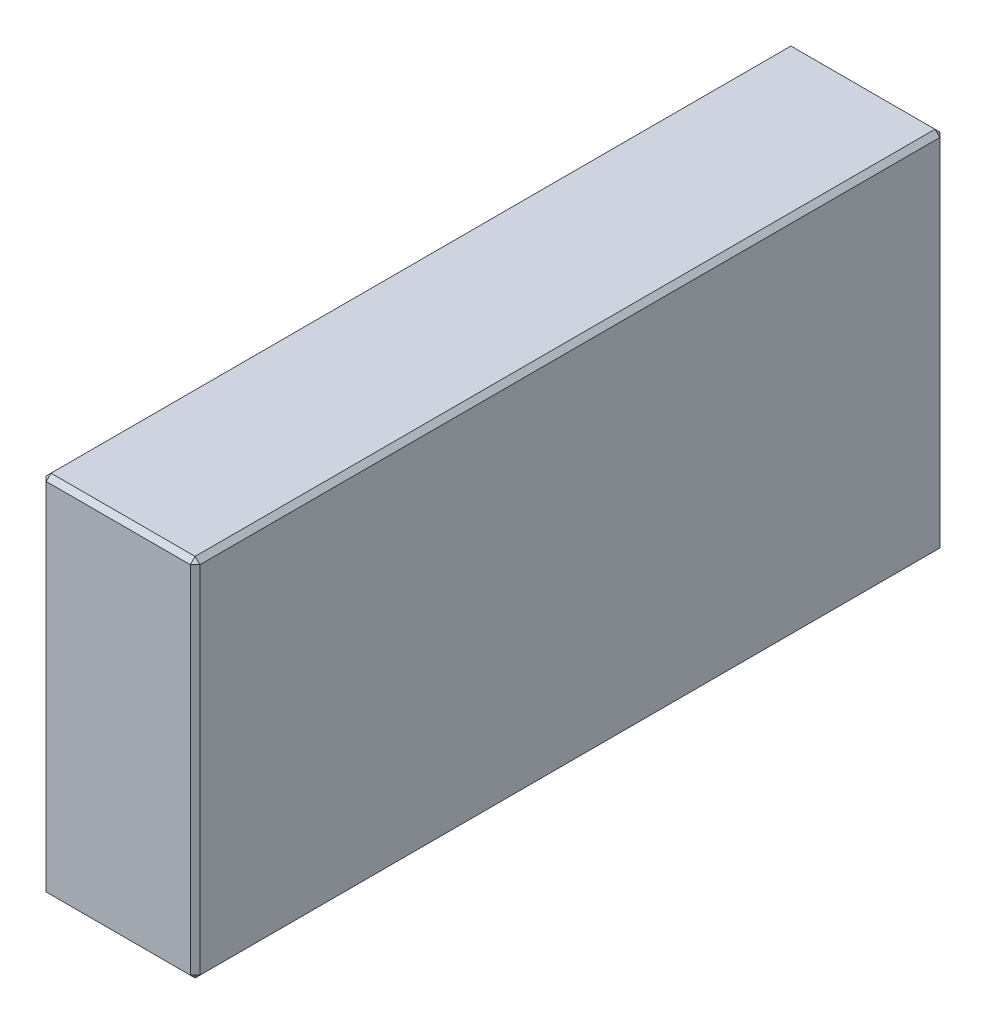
ISO-10303-21;
HEADER;
FILE_DESCRIPTION(('STEP AP214'),'2;1');
FILE_NAME('part.step','',(''),(''),'','','');
FILE_SCHEMA(('AUTOMOTIVE_DESIGN { 1 0 10303 214 1 1 1 1 }'));
ENDSEC;
DATA;
#1=APPLICATION_CONTEXT('core data for automotive mechanical design processes');
#2=APPLICATION_PROTOCOL_DEFINITION('international standard','automotive_design',2000,#1);
#3=PRODUCT_CONTEXT('',#1,'mechanical');
#4=PRODUCT('Part','Part','',(#3));
#5=PRODUCT_RELATED_PRODUCT_CATEGORY('part','',(#4));
#6=PRODUCT_DEFINITION_FORMATION('','',#4);
#7=PRODUCT_DEFINITION_CONTEXT('part definition',#1,'design');
#8=PRODUCT_DEFINITION('design','',#6,#7);
#9=PRODUCT_DEFINITION_SHAPE('','',#8);
#10=(LENGTH_UNIT() NAMED_UNIT(*) SI_UNIT(.MILLI.,.METRE.));
#11=(NAMED_UNIT(*) PLANE_ANGLE_UNIT() SI_UNIT($,.RADIAN.));
#12=(NAMED_UNIT(*) SI_UNIT($,.STERADIAN.) SOLID_ANGLE_UNIT());
#13=UNCERTAINTY_MEASURE_WITH_UNIT(LENGTH_MEASURE(1.E-05),#10,'distance_accuracy_value','');
#14=(GEOMETRIC_REPRESENTATION_CONTEXT(3) GLOBAL_UNCERTAINTY_ASSIGNED_CONTEXT((#13)) GLOBAL_UNIT_ASSIGNED_CONTEXT((#10,
#11,#12)) REPRESENTATION_CONTEXT('',''));
#15=CARTESIAN_POINT('',(0.,0.,0.));
#16=DIRECTION('',(0.,0.,1.));
#17=DIRECTION('',(1.,0.,0.));
#18=AXIS2_PLACEMENT_3D('',#15,#16,#17);
#19=CARTESIAN_POINT('',(-16.,76.,78.));
#20=DIRECTION('',(1.,0.,0.));
#21=DIRECTION('',(0.,0.,-1.));
#22=AXIS2_PLACEMENT_3D('',#19,#20,#21);
#23=PLANE('',#22);
#24=DIRECTION('',(0.,-1.,0.));
#25=VECTOR('',#24,1.);
#26=CARTESIAN_POINT('',(-16.,76.,-77.));
#27=LINE('',#26,#25);
#28=CARTESIAN_POINT('',(-16.,75.,-77.));
#29=VERTEX_POINT('',#28);
#30=CARTESIAN_POINT('',(-16.,1.00000000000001,-77.));
#31=VERTEX_POINT('',#30);
#32=EDGE_CURVE('E114',#29,#31,#27,.T.);
#33=ORIENTED_EDGE('',*,*,#32,.T.);
#34=DIRECTION('',(0.,0.,1.));
#35=VECTOR('',#34,1.);
#36=CARTESIAN_POINT('',(-16.,1.00000000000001,78.));
#37=LINE('',#36,#35);
#38=CARTESIAN_POINT('',(-16.,1.00000000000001,77.));
#39=VERTEX_POINT('',#38);
#40=EDGE_CURVE('E110',#31,#39,#37,.T.);
#41=ORIENTED_EDGE('',*,*,#40,.T.);
#42=DIRECTION('',(0.,1.,0.));
#43=VECTOR('',#42,1.);
#44=CARTESIAN_POINT('',(-16.,76.,77.));
#45=LINE('',#44,#43);
#46=CARTESIAN_POINT('',(-16.,75.,77.));
#47=VERTEX_POINT('',#46);
#48=EDGE_CURVE('E103',#39,#47,#45,.T.);
#49=ORIENTED_EDGE('',*,*,#48,.T.);
#50=DIRECTION('',(0.,0.,-1.));
#51=VECTOR('',#50,1.);
#52=CARTESIAN_POINT('',(-16.,75.,-78.));
#53=LINE('',#52,#51);
#54=EDGE_CURVE('E107',#47,#29,#53,.T.);
#55=ORIENTED_EDGE('',*,*,#54,.T.);
#56=EDGE_LOOP('',(#33,#41,#49,#55));
#57=FACE_BOUND('',#56,.T.);
#58=ADVANCED_FACE('F15',(#57),#23,.F.);
#59=CARTESIAN_POINT('',(16.,76.,78.));
#60=DIRECTION('',(0.,0.,-1.));
#61=DIRECTION('',(-1.,0.,0.));
#62=AXIS2_PLACEMENT_3D('',#59,#60,#61);
#63=PLANE('',#62);
#64=DIRECTION('',(-1.,0.,0.));
#65=VECTOR('',#64,1.);
#66=CARTESIAN_POINT('',(-16.,75.,78.));
#67=LINE('',#66,#65);
#68=CARTESIAN_POINT('',(15.,75.,78.));
#69=VERTEX_POINT('',#68);
#70=CARTESIAN_POINT('',(-15.,75.,78.));
#71=VERTEX_POINT('',#70);
#72=EDGE_CURVE('E164',#69,#71,#67,.T.);
#73=ORIENTED_EDGE('',*,*,#72,.T.);
#74=DIRECTION('',(0.,-1.,0.));
#75=VECTOR('',#74,1.);
#76=CARTESIAN_POINT('',(-15.,76.,78.));
#77=LINE('',#76,#75);
#78=CARTESIAN_POINT('',(-15.,1.,78.));
#79=VERTEX_POINT('',#78);
#80=EDGE_CURVE('E122',#71,#79,#77,.T.);
#81=ORIENTED_EDGE('',*,*,#80,.T.);
#82=DIRECTION('',(1.,0.,0.));
#83=VECTOR('',#82,1.);
#84=CARTESIAN_POINT('',(16.,1.,78.));
#85=LINE('',#84,#83);
#86=CARTESIAN_POINT('',(15.,1.,78.));
#87=VERTEX_POINT('',#86);
#88=EDGE_CURVE('E168',#79,#87,#85,.T.);
#89=ORIENTED_EDGE('',*,*,#88,.T.);
#90=DIRECTION('',(0.,1.,0.));
#91=VECTOR('',#90,1.);
#92=CARTESIAN_POINT('',(15.,76.,78.));
#93=LINE('',#92,#91);
#94=EDGE_CURVE('E166',#87,#69,#93,.T.);
#95=ORIENTED_EDGE('',*,*,#94,.T.);
#96=EDGE_LOOP('',(#73,#81,#89,#95));
#97=FACE_BOUND('',#96,.T.);
#98=ADVANCED_FACE('F275',(#97),#63,.F.);
#99=CARTESIAN_POINT('',(16.,76.,78.));
#100=DIRECTION('',(-1.,0.,0.));
#101=DIRECTION('',(0.,0.,1.));
#102=AXIS2_PLACEMENT_3D('',#99,#100,#101);
#103=PLANE('',#102);
#104=DIRECTION('',(0.,0.,-1.));
#105=VECTOR('',#104,1.);
#106=CARTESIAN_POINT('',(16.,1.,78.));
#107=LINE('',#106,#105);
#108=CARTESIAN_POINT('',(16.,1.,77.));
#109=VERTEX_POINT('',#108);
#110=CARTESIAN_POINT('',(16.,1.,-77.));
#111=VERTEX_POINT('',#110);
#112=EDGE_CURVE('E159',#109,#111,#107,.T.);
#113=ORIENTED_EDGE('',*,*,#112,.T.);
#114=DIRECTION('',(0.,1.,0.));
#115=VECTOR('',#114,1.);
#116=CARTESIAN_POINT('',(16.,76.,-77.));
#117=LINE('',#116,#115);
#118=CARTESIAN_POINT('',(16.,75.,-77.));
#119=VERTEX_POINT('',#118);
#120=EDGE_CURVE('E161',#111,#119,#117,.T.);
#121=ORIENTED_EDGE('',*,*,#120,.T.);
#122=DIRECTION('',(0.,0.,1.));
#123=VECTOR('',#122,1.);
#124=CARTESIAN_POINT('',(16.,75.,78.));
#125=LINE('',#124,#123);
#126=CARTESIAN_POINT('',(16.,75.,77.));
#127=VERTEX_POINT('',#126);
#128=EDGE_CURVE('E155',#119,#127,#125,.T.);
#129=ORIENTED_EDGE('',*,*,#128,.T.);
#130=DIRECTION('',(0.,-1.,0.));
#131=VECTOR('',#130,1.);
#132=CARTESIAN_POINT('',(16.,76.,77.));
#133=LINE('',#132,#131);
#134=EDGE_CURVE('E157',#127,#109,#133,.T.);
#135=ORIENTED_EDGE('',*,*,#134,.T.);
#136=EDGE_LOOP('',(#113,#121,#129,#135));
#137=FACE_BOUND('',#136,.T.);
#138=ADVANCED_FACE('F254',(#137),#103,.F.);
#139=CARTESIAN_POINT('',(16.,76.,-78.));
#140=DIRECTION('',(0.,0.,1.));
#141=DIRECTION('',(1.,0.,0.));
#142=AXIS2_PLACEMENT_3D('',#139,#140,#141);
#143=PLANE('',#142);
#144=DIRECTION('',(0.,-1.,0.));
#145=VECTOR('',#144,1.);
#146=CARTESIAN_POINT('',(15.,76.,-78.));
#147=LINE('',#146,#145);
#148=CARTESIAN_POINT('',(15.,75.,-78.));
#149=VERTEX_POINT('',#148);
#150=CARTESIAN_POINT('',(15.,1.,-78.));
#151=VERTEX_POINT('',#150);
#152=EDGE_CURVE('E148',#149,#151,#147,.T.);
#153=ORIENTED_EDGE('',*,*,#152,.T.);
#154=DIRECTION('',(-1.,0.,0.));
#155=VECTOR('',#154,1.);
#156=CARTESIAN_POINT('',(16.,1.,-78.));
#157=LINE('',#156,#155);
#158=CARTESIAN_POINT('',(-15.,1.,-78.));
#159=VERTEX_POINT('',#158);
#160=EDGE_CURVE('E153',#151,#159,#157,.T.);
#161=ORIENTED_EDGE('',*,*,#160,.T.);
#162=DIRECTION('',(0.,1.,0.));
#163=VECTOR('',#162,1.);
#164=CARTESIAN_POINT('',(-15.,76.,-78.));
#165=LINE('',#164,#163);
#166=CARTESIAN_POINT('',(-15.,75.,-78.));
#167=VERTEX_POINT('',#166);
#168=EDGE_CURVE('E150',#159,#167,#165,.T.);
#169=ORIENTED_EDGE('',*,*,#168,.T.);
#170=DIRECTION('',(1.,0.,0.));
#171=VECTOR('',#170,1.);
#172=CARTESIAN_POINT('',(16.,75.,-78.));
#173=LINE('',#172,#171);
#174=EDGE_CURVE('E146',#167,#149,#173,.T.);
#175=ORIENTED_EDGE('',*,*,#174,.T.);
#176=EDGE_LOOP('',(#153,#161,#169,#175));
#177=FACE_BOUND('',#176,.T.);
#178=ADVANCED_FACE('F284',(#177),#143,.F.);
#179=CARTESIAN_POINT('',(0.,76.,0.));
#180=DIRECTION('',(0.,1.,0.));
#181=DIRECTION('',(0.,0.,1.));
#182=AXIS2_PLACEMENT_3D('',#179,#180,#181);
#183=PLANE('',#182);
#184=DIRECTION('',(0.,0.,-1.));
#185=VECTOR('',#184,1.);
#186=CARTESIAN_POINT('',(15.,76.,-78.));
#187=LINE('',#186,#185);
#188=CARTESIAN_POINT('',(15.,76.,77.));
#189=VERTEX_POINT('',#188);
#190=CARTESIAN_POINT('',(15.,76.,-77.));
#191=VERTEX_POINT('',#190);
#192=EDGE_CURVE('E24',#189,#191,#187,.T.);
#193=ORIENTED_EDGE('',*,*,#192,.T.);
#194=DIRECTION('',(-1.,0.,0.));
#195=VECTOR('',#194,1.);
#196=CARTESIAN_POINT('',(-16.,76.,-77.));
#197=LINE('',#196,#195);
#198=CARTESIAN_POINT('',(-15.,76.,-77.));
#199=VERTEX_POINT('',#198);
#200=EDGE_CURVE('E9',#191,#199,#197,.T.);
#201=ORIENTED_EDGE('',*,*,#200,.T.);
#202=DIRECTION('',(0.,0.,1.));
#203=VECTOR('',#202,1.);
#204=CARTESIAN_POINT('',(-15.,76.,78.));
#205=LINE('',#204,#203);
#206=CARTESIAN_POINT('',(-15.,76.,77.));
#207=VERTEX_POINT('',#206);
#208=EDGE_CURVE('E180',#199,#207,#205,.T.);
#209=ORIENTED_EDGE('',*,*,#208,.T.);
#210=DIRECTION('',(1.,0.,0.));
#211=VECTOR('',#210,1.);
#212=CARTESIAN_POINT('',(16.,76.,77.));
#213=LINE('',#212,#211);
#214=EDGE_CURVE('E35',#207,#189,#213,.T.);
#215=ORIENTED_EDGE('',*,*,#214,.T.);
#216=EDGE_LOOP('',(#193,#201,#209,#215));
#217=FACE_BOUND('',#216,.T.);
#218=ADVANCED_FACE('F350',(#217),#183,.T.);
#219=CARTESIAN_POINT('',(0.,0.,0.));
#220=DIRECTION('',(0.,1.,0.));
#221=DIRECTION('',(0.,0.,1.));
#222=AXIS2_PLACEMENT_3D('',#219,#220,#221);
#223=PLANE('',#222);
#224=DIRECTION('',(0.,0.,1.));
#225=VECTOR('',#224,1.);
#226=CARTESIAN_POINT('',(15.,0.,0.));
#227=LINE('',#226,#225);
#228=CARTESIAN_POINT('',(15.,0.,-77.));
#229=VERTEX_POINT('',#228);
#230=CARTESIAN_POINT('',(15.,0.,77.));
#231=VERTEX_POINT('',#230);
#232=EDGE_CURVE('E171',#229,#231,#227,.T.);
#233=ORIENTED_EDGE('',*,*,#232,.T.);
#234=DIRECTION('',(-1.,0.,0.));
#235=VECTOR('',#234,1.);
#236=CARTESIAN_POINT('',(0.,0.,77.));
#237=LINE('',#236,#235);
#238=CARTESIAN_POINT('',(-15.,0.,77.));
#239=VERTEX_POINT('',#238);
#240=EDGE_CURVE('E177',#231,#239,#237,.T.);
#241=ORIENTED_EDGE('',*,*,#240,.T.);
#242=DIRECTION('',(0.,0.,-1.));
#243=VECTOR('',#242,1.);
#244=CARTESIAN_POINT('',(-15.,0.,0.));
#245=LINE('',#244,#243);
#246=CARTESIAN_POINT('',(-15.,0.,-77.));
#247=VERTEX_POINT('',#246);
#248=EDGE_CURVE('E175',#239,#247,#245,.T.);
#249=ORIENTED_EDGE('',*,*,#248,.T.);
#250=DIRECTION('',(1.,0.,0.));
#251=VECTOR('',#250,1.);
#252=CARTESIAN_POINT('',(0.,0.,-77.));
#253=LINE('',#252,#251);
#254=EDGE_CURVE('E173',#247,#229,#253,.T.);
#255=ORIENTED_EDGE('',*,*,#254,.T.);
#256=EDGE_LOOP('',(#233,#241,#249,#255));
#257=FACE_BOUND('',#256,.T.);
#258=ADVANCED_FACE('F246',(#257),#223,.F.);
#259=CARTESIAN_POINT('',(16.,76.,77.));
#260=DIRECTION('',(-0.707106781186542,0.,-0.707106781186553));
#261=DIRECTION('',(0.,-1.,0.));
#262=AXIS2_PLACEMENT_3D('',#259,#260,#261);
#263=PLANE('',#262);
#264=DIRECTION('',(-0.707106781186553,0.,0.707106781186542));
#265=VECTOR('',#264,1.);
#266=CARTESIAN_POINT('',(15.,75.,78.));
#267=LINE('',#266,#265);
#268=EDGE_CURVE('E19',#69,#127,#267,.F.);
#269=ORIENTED_EDGE('',*,*,#268,.F.);
#270=ORIENTED_EDGE('',*,*,#94,.F.);
#271=DIRECTION('',(0.707106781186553,0.,-0.707106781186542));
#272=VECTOR('',#271,1.);
#273=CARTESIAN_POINT('',(15.,1.,78.));
#274=LINE('',#273,#272);
#275=EDGE_CURVE('E142',#109,#87,#274,.F.);
#276=ORIENTED_EDGE('',*,*,#275,.F.);
#277=ORIENTED_EDGE('',*,*,#134,.F.);
#278=EDGE_LOOP('',(#269,#270,#276,#277));
#279=FACE_BOUND('',#278,.T.);
#280=ADVANCED_FACE('F17',(#279),#263,.F.);
#281=CARTESIAN_POINT('',(15.,75.,78.));
#282=DIRECTION('',(0.577350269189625,0.577350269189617,0.577350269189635));
#283=DIRECTION('',(0.707106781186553,0.,-0.707106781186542));
#284=AXIS2_PLACEMENT_3D('',#281,#282,#283);
#285=PLANE('',#284);
#286=DIRECTION('',(0.,-0.707106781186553,0.707106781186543));
#287=VECTOR('',#286,1.);
#288=CARTESIAN_POINT('',(15.,75.,78.));
#289=LINE('',#288,#287);
#290=EDGE_CURVE('E226',#69,#189,#289,.F.);
#291=ORIENTED_EDGE('',*,*,#290,.F.);
#292=ORIENTED_EDGE('',*,*,#268,.T.);
#293=DIRECTION('',(-0.707106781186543,0.707106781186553,0.));
#294=VECTOR('',#293,1.);
#295=CARTESIAN_POINT('',(15.5,75.5,77.));
#296=LINE('',#295,#294);
#297=EDGE_CURVE('E228',#189,#127,#296,.F.);
#298=ORIENTED_EDGE('',*,*,#297,.F.);
#299=EDGE_LOOP('',(#291,#292,#298));
#300=FACE_BOUND('',#299,.T.);
#301=ADVANCED_FACE('F270',(#300),#285,.T.);
#302=CARTESIAN_POINT('',(15.,1.,78.));
#303=DIRECTION('',(0.577350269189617,-0.577350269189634,0.577350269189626));
#304=DIRECTION('',(0.,-0.707106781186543,-0.707106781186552));
#305=AXIS2_PLACEMENT_3D('',#302,#303,#304);
#306=PLANE('',#305);
#307=DIRECTION('',(-0.707106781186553,-0.707106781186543,0.));
#308=VECTOR('',#307,1.);
#309=CARTESIAN_POINT('',(15.5,0.5,77.));
#310=LINE('',#309,#308);
#311=EDGE_CURVE('E220',#109,#231,#310,.T.);
#312=ORIENTED_EDGE('',*,*,#311,.F.);
#313=ORIENTED_EDGE('',*,*,#275,.T.);
#314=DIRECTION('',(0.,0.707106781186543,0.707106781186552));
#315=VECTOR('',#314,1.);
#316=CARTESIAN_POINT('',(15.,1.,78.));
#317=LINE('',#316,#315);
#318=EDGE_CURVE('E223',#231,#87,#317,.T.);
#319=ORIENTED_EDGE('',*,*,#318,.F.);
#320=EDGE_LOOP('',(#312,#313,#319));
#321=FACE_BOUND('',#320,.T.);
#322=ADVANCED_FACE('F235',(#321),#306,.T.);
#323=CARTESIAN_POINT('',(15.,76.,0.));
#324=DIRECTION('',(0.707106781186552,0.707106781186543,0.));
#325=DIRECTION('',(0.,0.,1.));
#326=AXIS2_PLACEMENT_3D('',#323,#324,#325);
#327=PLANE('',#326);
#328=ORIENTED_EDGE('',*,*,#297,.T.);
#329=ORIENTED_EDGE('',*,*,#128,.F.);
#330=DIRECTION('',(0.707106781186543,-0.707106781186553,0.));
#331=VECTOR('',#330,1.);
#332=CARTESIAN_POINT('',(16.,75.,-77.));
#333=LINE('',#332,#331);
#334=EDGE_CURVE('E215',#191,#119,#333,.T.);
#335=ORIENTED_EDGE('',*,*,#334,.F.);
#336=ORIENTED_EDGE('',*,*,#192,.F.);
#337=EDGE_LOOP('',(#328,#329,#335,#336));
#338=FACE_BOUND('',#337,.T.);
#339=ADVANCED_FACE('F265',(#338),#327,.T.);
#340=CARTESIAN_POINT('',(0.,76.,77.));
#341=DIRECTION('',(0.,0.707106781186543,0.707106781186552));
#342=DIRECTION('',(-1.,0.,0.));
#343=AXIS2_PLACEMENT_3D('',#340,#341,#342);
#344=PLANE('',#343);
#345=ORIENTED_EDGE('',*,*,#290,.T.);
#346=ORIENTED_EDGE('',*,*,#214,.F.);
#347=DIRECTION('',(0.,0.707106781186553,-0.707106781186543));
#348=VECTOR('',#347,1.);
#349=CARTESIAN_POINT('',(-15.,75.5,77.5));
#350=LINE('',#349,#348);
#351=EDGE_CURVE('E126',#71,#207,#350,.T.);
#352=ORIENTED_EDGE('',*,*,#351,.F.);
#353=ORIENTED_EDGE('',*,*,#72,.F.);
#354=EDGE_LOOP('',(#345,#346,#352,#353));
#355=FACE_BOUND('',#354,.T.);
#356=ADVANCED_FACE('F273',(#355),#344,.T.);
#357=CARTESIAN_POINT('',(-15.,76.,78.));
#358=DIRECTION('',(0.707106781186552,0.,-0.707106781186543));
#359=DIRECTION('',(0.,-1.,0.));
#360=AXIS2_PLACEMENT_3D('',#357,#358,#359);
#361=PLANE('',#360);
#362=DIRECTION('',(0.707106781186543,0.,0.707106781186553));
#363=VECTOR('',#362,1.);
#364=CARTESIAN_POINT('',(-15.,1.,78.));
#365=LINE('',#364,#363);
#366=EDGE_CURVE('E127',#79,#39,#365,.F.);
#367=ORIENTED_EDGE('',*,*,#366,.F.);
#368=ORIENTED_EDGE('',*,*,#80,.F.);
#369=DIRECTION('',(-0.707106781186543,0.,-0.707106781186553));
#370=VECTOR('',#369,1.);
#371=CARTESIAN_POINT('',(-16.,75.,77.));
#372=LINE('',#371,#370);
#373=EDGE_CURVE('E118',#47,#71,#372,.F.);
#374=ORIENTED_EDGE('',*,*,#373,.F.);
#375=ORIENTED_EDGE('',*,*,#48,.F.);
#376=EDGE_LOOP('',(#367,#368,#374,#375));
#377=FACE_BOUND('',#376,.T.);
#378=ADVANCED_FACE('F120',(#377),#361,.F.);
#379=CARTESIAN_POINT('',(16.,1.,78.));
#380=DIRECTION('',(0.,0.707106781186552,-0.707106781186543));
#381=DIRECTION('',(1.,0.,0.));
#382=AXIS2_PLACEMENT_3D('',#379,#380,#381);
#383=PLANE('',#382);
#384=ORIENTED_EDGE('',*,*,#318,.T.);
#385=ORIENTED_EDGE('',*,*,#88,.F.);
#386=DIRECTION('',(0.,-0.707106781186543,-0.707106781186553));
#387=VECTOR('',#386,1.);
#388=CARTESIAN_POINT('',(-15.,1.,78.));
#389=LINE('',#388,#387);
#390=EDGE_CURVE('E211',#239,#79,#389,.F.);
#391=ORIENTED_EDGE('',*,*,#390,.F.);
#392=ORIENTED_EDGE('',*,*,#240,.F.);
#393=EDGE_LOOP('',(#384,#385,#391,#392));
#394=FACE_BOUND('',#393,.T.);
#395=ADVANCED_FACE('F243',(#394),#383,.F.);
#396=CARTESIAN_POINT('',(16.,1.,78.));
#397=DIRECTION('',(-0.707106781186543,0.707106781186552,0.));
#398=DIRECTION('',(0.,0.,-1.));
#399=AXIS2_PLACEMENT_3D('',#396,#397,#398);
#400=PLANE('',#399);
#401=ORIENTED_EDGE('',*,*,#311,.T.);
#402=ORIENTED_EDGE('',*,*,#232,.F.);
#403=DIRECTION('',(0.707106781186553,0.707106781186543,0.));
#404=VECTOR('',#403,1.);
#405=CARTESIAN_POINT('',(15.5,0.500000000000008,-77.));
#406=LINE('',#405,#404);
#407=EDGE_CURVE('E208',#111,#229,#406,.F.);
#408=ORIENTED_EDGE('',*,*,#407,.F.);
#409=ORIENTED_EDGE('',*,*,#112,.F.);
#410=EDGE_LOOP('',(#401,#402,#408,#409));
#411=FACE_BOUND('',#410,.T.);
#412=ADVANCED_FACE('F251',(#411),#400,.F.);
#413=CARTESIAN_POINT('',(15.,76.,-78.));
#414=DIRECTION('',(-0.707106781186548,0.,0.707106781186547));
#415=DIRECTION('',(0.,-1.,0.));
#416=AXIS2_PLACEMENT_3D('',#413,#414,#415);
#417=PLANE('',#416);
#418=DIRECTION('',(0.707106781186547,0.,0.707106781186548));
#419=VECTOR('',#418,1.);
#420=CARTESIAN_POINT('',(16.,75.,-77.));
#421=LINE('',#420,#419);
#422=EDGE_CURVE('E217',#119,#149,#421,.F.);
#423=ORIENTED_EDGE('',*,*,#422,.F.);
#424=ORIENTED_EDGE('',*,*,#120,.F.);
#425=DIRECTION('',(-0.707106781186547,0.,-0.707106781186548));
#426=VECTOR('',#425,1.);
#427=CARTESIAN_POINT('',(15.,1.,-78.));
#428=LINE('',#427,#426);
#429=EDGE_CURVE('E205',#151,#111,#428,.F.);
#430=ORIENTED_EDGE('',*,*,#429,.F.);
#431=ORIENTED_EDGE('',*,*,#152,.F.);
#432=EDGE_LOOP('',(#423,#424,#430,#431));
#433=FACE_BOUND('',#432,.T.);
#434=ADVANCED_FACE('F258',(#433),#417,.F.);
#435=CARTESIAN_POINT('',(16.,75.,-77.));
#436=DIRECTION('',(0.577350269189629,0.577350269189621,-0.577350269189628));
#437=DIRECTION('',(-0.707106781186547,0.,-0.707106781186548));
#438=AXIS2_PLACEMENT_3D('',#435,#436,#437);
#439=PLANE('',#438);
#440=ORIENTED_EDGE('',*,*,#334,.T.);
#441=ORIENTED_EDGE('',*,*,#422,.T.);
#442=DIRECTION('',(0.,0.707106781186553,0.707106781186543));
#443=VECTOR('',#442,1.);
#444=CARTESIAN_POINT('',(15.,75.5,-77.5));
#445=LINE('',#444,#443);
#446=EDGE_CURVE('E134',#191,#149,#445,.F.);
#447=ORIENTED_EDGE('',*,*,#446,.F.);
#448=EDGE_LOOP('',(#440,#441,#447));
#449=FACE_BOUND('',#448,.T.);
#450=ADVANCED_FACE('F325',(#449),#439,.T.);
#451=CARTESIAN_POINT('',(-16.,75.,77.));
#452=DIRECTION('',(-0.577350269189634,0.577350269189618,0.577350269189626));
#453=DIRECTION('',(0.707106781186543,0.,0.707106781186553));
#454=AXIS2_PLACEMENT_3D('',#451,#452,#453);
#455=PLANE('',#454);
#456=ORIENTED_EDGE('',*,*,#373,.T.);
#457=ORIENTED_EDGE('',*,*,#351,.T.);
#458=DIRECTION('',(-0.707106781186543,-0.707106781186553,0.));
#459=VECTOR('',#458,1.);
#460=CARTESIAN_POINT('',(-16.,75.,77.));
#461=LINE('',#460,#459);
#462=EDGE_CURVE('E130',#47,#207,#461,.F.);
#463=ORIENTED_EDGE('',*,*,#462,.F.);
#464=EDGE_LOOP('',(#456,#457,#463));
#465=FACE_BOUND('',#464,.T.);
#466=ADVANCED_FACE('F131',(#465),#455,.T.);
#467=CARTESIAN_POINT('',(-15.,1.,78.));
#468=DIRECTION('',(-0.577350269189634,-0.577350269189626,0.577350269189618));
#469=DIRECTION('',(0.707106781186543,-0.707106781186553,0.));
#470=AXIS2_PLACEMENT_3D('',#467,#468,#469);
#471=PLANE('',#470);
#472=ORIENTED_EDGE('',*,*,#390,.T.);
#473=ORIENTED_EDGE('',*,*,#366,.T.);
#474=DIRECTION('',(-0.707106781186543,0.707106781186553,0.));
#475=VECTOR('',#474,1.);
#476=CARTESIAN_POINT('',(-15.5,0.500000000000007,77.));
#477=LINE('',#476,#475);
#478=EDGE_CURVE('E135',#239,#39,#477,.T.);
#479=ORIENTED_EDGE('',*,*,#478,.F.);
#480=EDGE_LOOP('',(#472,#473,#479));
#481=FACE_BOUND('',#480,.T.);
#482=ADVANCED_FACE('F318',(#481),#471,.T.);
#483=CARTESIAN_POINT('',(15.,1.,-78.));
#484=DIRECTION('',(0.577350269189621,-0.577350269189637,-0.57735026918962));
#485=DIRECTION('',(0.707106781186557,0.707106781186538,0.));
#486=AXIS2_PLACEMENT_3D('',#483,#484,#485);
#487=PLANE('',#486);
#488=ORIENTED_EDGE('',*,*,#429,.T.);
#489=ORIENTED_EDGE('',*,*,#407,.T.);
#490=DIRECTION('',(0.,-0.707106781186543,0.707106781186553));
#491=VECTOR('',#490,1.);
#492=CARTESIAN_POINT('',(15.,1.,-78.));
#493=LINE('',#492,#491);
#494=EDGE_CURVE('E198',#151,#229,#493,.T.);
#495=ORIENTED_EDGE('',*,*,#494,.F.);
#496=EDGE_LOOP('',(#488,#489,#495));
#497=FACE_BOUND('',#496,.T.);
#498=ADVANCED_FACE('F314',(#497),#487,.T.);
#499=CARTESIAN_POINT('',(0.,76.,-77.));
#500=DIRECTION('',(0.,0.707106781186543,-0.707106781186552));
#501=DIRECTION('',(1.,0.,0.));
#502=AXIS2_PLACEMENT_3D('',#499,#500,#501);
#503=PLANE('',#502);
#504=ORIENTED_EDGE('',*,*,#446,.T.);
#505=ORIENTED_EDGE('',*,*,#174,.F.);
#506=DIRECTION('',(0.,-0.707106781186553,-0.707106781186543));
#507=VECTOR('',#506,1.);
#508=CARTESIAN_POINT('',(-15.,75.,-78.));
#509=LINE('',#508,#507);
#510=EDGE_CURVE('E195',#199,#167,#509,.T.);
#511=ORIENTED_EDGE('',*,*,#510,.F.);
#512=ORIENTED_EDGE('',*,*,#200,.F.);
#513=EDGE_LOOP('',(#504,#505,#511,#512));
#514=FACE_BOUND('',#513,.T.);
#515=ADVANCED_FACE('F311',(#514),#503,.T.);
#516=CARTESIAN_POINT('',(-15.,76.,0.));
#517=DIRECTION('',(-0.707106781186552,0.707106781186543,0.));
#518=DIRECTION('',(0.,0.,-1.));
#519=AXIS2_PLACEMENT_3D('',#516,#517,#518);
#520=PLANE('',#519);
#521=ORIENTED_EDGE('',*,*,#462,.T.);
#522=ORIENTED_EDGE('',*,*,#208,.F.);
#523=DIRECTION('',(0.707106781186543,0.707106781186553,0.));
#524=VECTOR('',#523,1.);
#525=CARTESIAN_POINT('',(-15.5,75.5,-77.));
#526=LINE('',#525,#524);
#527=EDGE_CURVE('E138',#29,#199,#526,.T.);
#528=ORIENTED_EDGE('',*,*,#527,.F.);
#529=ORIENTED_EDGE('',*,*,#54,.F.);
#530=EDGE_LOOP('',(#521,#522,#528,#529));
#531=FACE_BOUND('',#530,.T.);
#532=ADVANCED_FACE('F137',(#531),#520,.T.);
#533=CARTESIAN_POINT('',(-16.,1.00000000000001,78.));
#534=DIRECTION('',(0.707106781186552,0.707106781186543,0.));
#535=DIRECTION('',(0.,0.,1.));
#536=AXIS2_PLACEMENT_3D('',#533,#534,#535);
#537=PLANE('',#536);
#538=ORIENTED_EDGE('',*,*,#478,.T.);
#539=ORIENTED_EDGE('',*,*,#40,.F.);
#540=DIRECTION('',(0.707106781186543,-0.707106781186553,0.));
#541=VECTOR('',#540,1.);
#542=CARTESIAN_POINT('',(-16.,1.00000000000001,-77.));
#543=LINE('',#542,#541);
#544=EDGE_CURVE('E191',#247,#31,#543,.F.);
#545=ORIENTED_EDGE('',*,*,#544,.F.);
#546=ORIENTED_EDGE('',*,*,#248,.F.);
#547=EDGE_LOOP('',(#538,#539,#545,#546));
#548=FACE_BOUND('',#547,.T.);
#549=ADVANCED_FACE('F304',(#548),#537,.F.);
#550=CARTESIAN_POINT('',(16.,1.,-78.));
#551=DIRECTION('',(0.,0.707106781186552,0.707106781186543));
#552=DIRECTION('',(-1.,0.,0.));
#553=AXIS2_PLACEMENT_3D('',#550,#551,#552);
#554=PLANE('',#553);
#555=ORIENTED_EDGE('',*,*,#494,.T.);
#556=ORIENTED_EDGE('',*,*,#254,.F.);
#557=DIRECTION('',(0.,0.707106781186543,-0.707106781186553));
#558=VECTOR('',#557,1.);
#559=CARTESIAN_POINT('',(-15.,0.499999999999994,-77.5));
#560=LINE('',#559,#558);
#561=EDGE_CURVE('E188',#159,#247,#560,.F.);
#562=ORIENTED_EDGE('',*,*,#561,.F.);
#563=ORIENTED_EDGE('',*,*,#160,.F.);
#564=EDGE_LOOP('',(#555,#556,#562,#563));
#565=FACE_BOUND('',#564,.T.);
#566=ADVANCED_FACE('F300',(#565),#554,.F.);
#567=CARTESIAN_POINT('',(-15.,75.,-78.));
#568=DIRECTION('',(-0.577350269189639,0.577350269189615,-0.577350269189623));
#569=DIRECTION('',(-0.707106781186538,0.,0.707106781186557));
#570=AXIS2_PLACEMENT_3D('',#567,#568,#569);
#571=PLANE('',#570);
#572=ORIENTED_EDGE('',*,*,#527,.T.);
#573=ORIENTED_EDGE('',*,*,#510,.T.);
#574=DIRECTION('',(0.707106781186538,0.,-0.707106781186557));
#575=VECTOR('',#574,1.);
#576=CARTESIAN_POINT('',(-15.,75.,-78.));
#577=LINE('',#576,#575);
#578=EDGE_CURVE('E186',#29,#167,#577,.T.);
#579=ORIENTED_EDGE('',*,*,#578,.F.);
#580=EDGE_LOOP('',(#572,#573,#579));
#581=FACE_BOUND('',#580,.T.);
#582=ADVANCED_FACE('F296',(#581),#571,.T.);
#583=CARTESIAN_POINT('',(-16.,1.00000000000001,-77.));
#584=DIRECTION('',(-0.577350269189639,-0.577350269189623,-0.577350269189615));
#585=DIRECTION('',(0.707106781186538,-0.707106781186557,0.));
#586=AXIS2_PLACEMENT_3D('',#583,#584,#585);
#587=PLANE('',#586);
#588=ORIENTED_EDGE('',*,*,#561,.T.);
#589=ORIENTED_EDGE('',*,*,#544,.T.);
#590=DIRECTION('',(-0.707106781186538,0.,0.707106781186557));
#591=VECTOR('',#590,1.);
#592=CARTESIAN_POINT('',(-16.,1.00000000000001,-77.));
#593=LINE('',#592,#591);
#594=EDGE_CURVE('E184',#159,#31,#593,.T.);
#595=ORIENTED_EDGE('',*,*,#594,.F.);
#596=EDGE_LOOP('',(#588,#589,#595));
#597=FACE_BOUND('',#596,.T.);
#598=ADVANCED_FACE('F292',(#597),#587,.T.);
#599=CARTESIAN_POINT('',(-16.,76.,-77.));
#600=DIRECTION('',(0.707106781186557,0.,0.707106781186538));
#601=DIRECTION('',(0.,-1.,0.));
#602=AXIS2_PLACEMENT_3D('',#599,#600,#601);
#603=PLANE('',#602);
#604=ORIENTED_EDGE('',*,*,#578,.T.);
#605=ORIENTED_EDGE('',*,*,#168,.F.);
#606=ORIENTED_EDGE('',*,*,#594,.T.);
#607=ORIENTED_EDGE('',*,*,#32,.F.);
#608=EDGE_LOOP('',(#604,#605,#606,#607));
#609=FACE_BOUND('',#608,.T.);
#610=ADVANCED_FACE('F289',(#609),#603,.F.);
#611=CLOSED_SHELL('',(#58,#98,#138,#178,#218,#258,#280,#301,#322,#339,#356,#378,#395,#412,#434,
#450,#466,#482,#498,#515,#532,#549,#566,#582,#598,#610));
#612=MANIFOLD_SOLID_BREP('B1',#611);
#613=ADVANCED_BREP_SHAPE_REPRESENTATION('',(#18,#612),#14);
#614=SHAPE_DEFINITION_REPRESENTATION(#9,#613);
ENDSEC;
END-ISO-10303-21;
